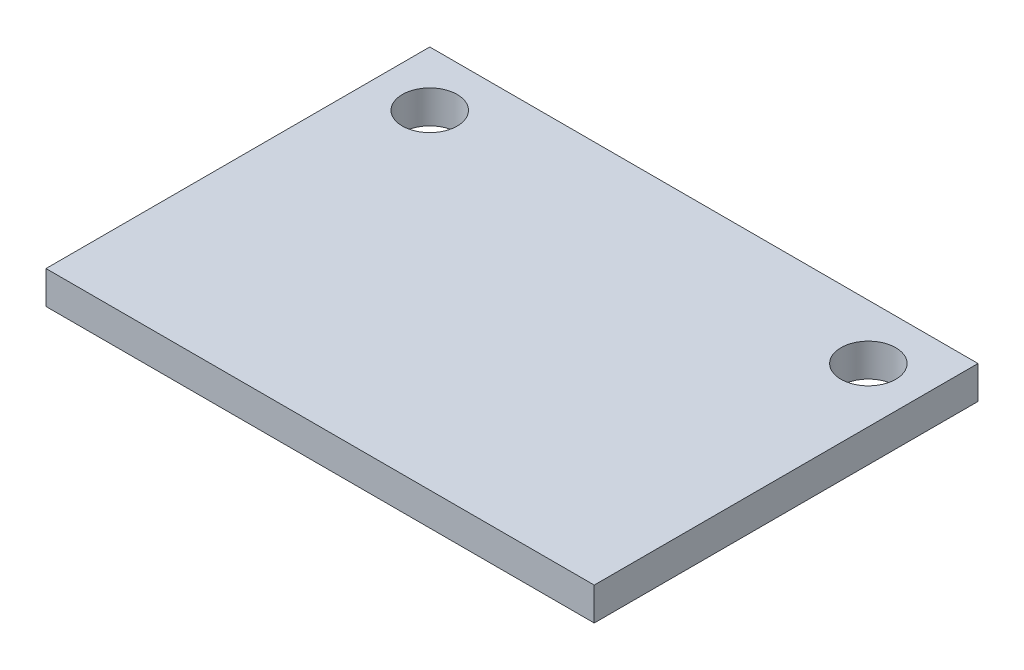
from build123d import *

# Parameters (mm, degrees)
SKETCH1_W           = 25.4
SKETCH1_H           = 17.78
SKETCH1_R           = 1.27
BOSS_EXTRUDE1_DEPTH = 1.524


with BuildPart() as part:
    # Sketch1 → Boss-Extrude1 (new body)
    with BuildSketch(Plane(origin=(0, 0, 0), x_dir=(1, 0, 0), z_dir=(0, 1, 0))):
        Rectangle(SKETCH1_W, SKETCH1_H)
        with Locations(Location((-10.16, 6.35, 0), (0, 0, 90))):
            Circle(SKETCH1_R, mode=Mode.SUBTRACT)
        with Locations(Location((10.16, 6.35, 0), (0, 0, 90))):
            Circle(SKETCH1_R, mode=Mode.SUBTRACT)
    extrude(amount=BOSS_EXTRUDE1_DEPTH)


solid = part.part
